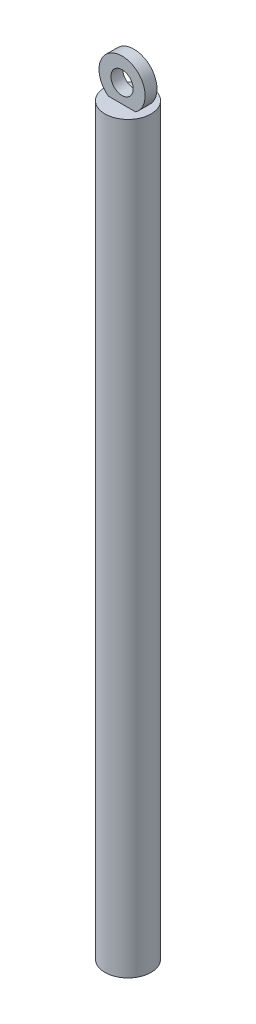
ISO-10303-21;
HEADER;
FILE_DESCRIPTION(('STEP AP214'),'2;1');
FILE_NAME('part.step','',(''),(''),'','','');
FILE_SCHEMA(('AUTOMOTIVE_DESIGN { 1 0 10303 214 1 1 1 1 }'));
ENDSEC;
DATA;
#1=APPLICATION_CONTEXT('core data for automotive mechanical design processes');
#2=APPLICATION_PROTOCOL_DEFINITION('international standard','automotive_design',2000,#1);
#3=PRODUCT_CONTEXT('',#1,'mechanical');
#4=PRODUCT('Part','Part','',(#3));
#5=PRODUCT_RELATED_PRODUCT_CATEGORY('part','',(#4));
#6=PRODUCT_DEFINITION_FORMATION('','',#4);
#7=PRODUCT_DEFINITION_CONTEXT('part definition',#1,'design');
#8=PRODUCT_DEFINITION('design','',#6,#7);
#9=PRODUCT_DEFINITION_SHAPE('','',#8);
#10=(LENGTH_UNIT() NAMED_UNIT(*) SI_UNIT(.MILLI.,.METRE.));
#11=(NAMED_UNIT(*) PLANE_ANGLE_UNIT() SI_UNIT($,.RADIAN.));
#12=(NAMED_UNIT(*) SI_UNIT($,.STERADIAN.) SOLID_ANGLE_UNIT());
#13=UNCERTAINTY_MEASURE_WITH_UNIT(LENGTH_MEASURE(1.E-05),#10,'distance_accuracy_value','');
#14=(GEOMETRIC_REPRESENTATION_CONTEXT(3) GLOBAL_UNCERTAINTY_ASSIGNED_CONTEXT((#13)) GLOBAL_UNIT_ASSIGNED_CONTEXT((#10,
#11,#12)) REPRESENTATION_CONTEXT('',''));
#15=CARTESIAN_POINT('',(0.,0.,0.));
#16=DIRECTION('',(0.,0.,1.));
#17=DIRECTION('',(1.,0.,0.));
#18=AXIS2_PLACEMENT_3D('',#15,#16,#17);
#19=CARTESIAN_POINT('',(0.,0.25,-0.4));
#20=DIRECTION('',(0.,0.,1.));
#21=DIRECTION('',(1.,0.,0.));
#22=AXIS2_PLACEMENT_3D('',#19,#20,#21);
#23=CYLINDRICAL_SURFACE('',#22,1.55);
#24=DIRECTION('',(0.,0.,1.));
#25=VECTOR('',#24,1.);
#26=CARTESIAN_POINT('',(0.916515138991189,-0.999999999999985,-0.4));
#27=LINE('',#26,#25);
#28=CARTESIAN_POINT('',(0.916515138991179,-0.999999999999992,0.4));
#29=VERTEX_POINT('',#28);
#30=CARTESIAN_POINT('',(0.916515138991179,-0.999999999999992,-0.4));
#31=VERTEX_POINT('',#30);
#32=EDGE_CURVE('E34',#29,#31,#27,.F.);
#33=ORIENTED_EDGE('',*,*,#32,.T.);
#34=CARTESIAN_POINT('',(0.,0.25,-0.4));
#35=DIRECTION('',(0.,0.,1.));
#36=DIRECTION('',(1.,0.,0.));
#37=AXIS2_PLACEMENT_3D('',#34,#35,#36);
#38=CIRCLE('',#37,1.55);
#39=CARTESIAN_POINT('',(-0.916515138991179,-0.999999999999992,-0.4));
#40=VERTEX_POINT('',#39);
#41=EDGE_CURVE('E19',#31,#40,#38,.T.);
#42=ORIENTED_EDGE('',*,*,#41,.T.);
#43=DIRECTION('',(0.,0.,1.));
#44=VECTOR('',#43,1.);
#45=CARTESIAN_POINT('',(-0.916515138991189,-0.999999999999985,-0.4));
#46=LINE('',#45,#44);
#47=CARTESIAN_POINT('',(-0.916515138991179,-0.999999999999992,0.4));
#48=VERTEX_POINT('',#47);
#49=EDGE_CURVE('E43',#40,#48,#46,.T.);
#50=ORIENTED_EDGE('',*,*,#49,.T.);
#51=CARTESIAN_POINT('',(0.,0.25,0.4));
#52=DIRECTION('',(0.,0.,1.));
#53=DIRECTION('',(1.,0.,0.));
#54=AXIS2_PLACEMENT_3D('',#51,#52,#53);
#55=CIRCLE('',#54,1.55);
#56=EDGE_CURVE('E59',#29,#48,#55,.T.);
#57=ORIENTED_EDGE('',*,*,#56,.F.);
#58=EDGE_LOOP('',(#33,#42,#50,#57));
#59=FACE_BOUND('',#58,.T.);
#60=ADVANCED_FACE('F16',(#59),#23,.T.);
#61=CARTESIAN_POINT('',(0.,0.25,-0.4));
#62=DIRECTION('',(0.,0.,1.));
#63=DIRECTION('',(1.,0.,0.));
#64=AXIS2_PLACEMENT_3D('',#61,#62,#63);
#65=CYLINDRICAL_SURFACE('',#64,0.75);
#66=CARTESIAN_POINT('',(0.,0.25,0.4));
#67=DIRECTION('',(0.,0.,1.));
#68=DIRECTION('',(1.,0.,0.));
#69=AXIS2_PLACEMENT_3D('',#66,#67,#68);
#70=CIRCLE('',#69,0.75);
#71=CARTESIAN_POINT('',(0.75,0.25,0.4));
#72=VERTEX_POINT('',#71);
#73=EDGE_CURVE('E55',#72,#72,#70,.F.);
#74=ORIENTED_EDGE('',*,*,#73,.F.);
#75=EDGE_LOOP('',(#74));
#76=FACE_BOUND('',#75,.T.);
#77=CARTESIAN_POINT('',(0.,0.25,-0.4));
#78=DIRECTION('',(0.,0.,1.));
#79=DIRECTION('',(1.,0.,0.));
#80=AXIS2_PLACEMENT_3D('',#77,#78,#79);
#81=CIRCLE('',#80,0.75);
#82=CARTESIAN_POINT('',(0.75,0.25,-0.4));
#83=VERTEX_POINT('',#82);
#84=EDGE_CURVE('E53',#83,#83,#81,.F.);
#85=ORIENTED_EDGE('',*,*,#84,.T.);
#86=EDGE_LOOP('',(#85));
#87=FACE_BOUND('',#86,.T.);
#88=ADVANCED_FACE('F68',(#76,#87),#65,.F.);
#89=CARTESIAN_POINT('',(0.,0.,-0.4));
#90=DIRECTION('',(0.,0.,1.));
#91=DIRECTION('',(1.,0.,0.));
#92=AXIS2_PLACEMENT_3D('',#89,#90,#91);
#93=PLANE('',#92);
#94=ORIENTED_EDGE('',*,*,#84,.F.);
#95=EDGE_LOOP('',(#94));
#96=FACE_BOUND('',#95,.T.);
#97=DIRECTION('',(1.,0.,0.));
#98=VECTOR('',#97,1.);
#99=CARTESIAN_POINT('',(0.,-1.,-0.4));
#100=LINE('',#99,#98);
#101=EDGE_CURVE('E47',#31,#40,#100,.F.);
#102=ORIENTED_EDGE('',*,*,#101,.T.);
#103=ORIENTED_EDGE('',*,*,#41,.F.);
#104=EDGE_LOOP('',(#102,#103));
#105=FACE_BOUND('',#104,.T.);
#106=ADVANCED_FACE('F54',(#96,#105),#93,.F.);
#107=CARTESIAN_POINT('',(0.,0.,0.4));
#108=DIRECTION('',(0.,0.,1.));
#109=DIRECTION('',(1.,0.,0.));
#110=AXIS2_PLACEMENT_3D('',#107,#108,#109);
#111=PLANE('',#110);
#112=ORIENTED_EDGE('',*,*,#73,.T.);
#113=EDGE_LOOP('',(#112));
#114=FACE_BOUND('',#113,.T.);
#115=ORIENTED_EDGE('',*,*,#56,.T.);
#116=DIRECTION('',(1.,0.,0.));
#117=VECTOR('',#116,1.);
#118=CARTESIAN_POINT('',(0.,-1.,0.4));
#119=LINE('',#118,#117);
#120=EDGE_CURVE('E49',#48,#29,#119,.T.);
#121=ORIENTED_EDGE('',*,*,#120,.T.);
#122=EDGE_LOOP('',(#115,#121));
#123=FACE_BOUND('',#122,.T.);
#124=ADVANCED_FACE('F71',(#114,#123),#111,.T.);
#125=CARTESIAN_POINT('',(0.,-51.,0.));
#126=DIRECTION('',(0.,-1.,0.));
#127=DIRECTION('',(0.,0.,-1.));
#128=AXIS2_PLACEMENT_3D('',#125,#126,#127);
#129=PLANE('',#128);
#130=CARTESIAN_POINT('',(0.,-51.,0.));
#131=DIRECTION('',(0.,-1.,0.));
#132=DIRECTION('',(0.,0.,-1.));
#133=AXIS2_PLACEMENT_3D('',#130,#131,#132);
#134=CIRCLE('',#133,1.55);
#135=CARTESIAN_POINT('',(0.,-51.,-1.55));
#136=VERTEX_POINT('',#135);
#137=EDGE_CURVE('E25',#136,#136,#134,.F.);
#138=ORIENTED_EDGE('',*,*,#137,.F.);
#139=EDGE_LOOP('',(#138));
#140=FACE_BOUND('',#139,.T.);
#141=ADVANCED_FACE('F78',(#140),#129,.T.);
#142=CARTESIAN_POINT('',(0.,-1.,0.));
#143=DIRECTION('',(0.,-1.,0.));
#144=DIRECTION('',(0.,0.,-1.));
#145=AXIS2_PLACEMENT_3D('',#142,#143,#144);
#146=PLANE('',#145);
#147=ORIENTED_EDGE('',*,*,#120,.F.);
#148=ORIENTED_EDGE('',*,*,#49,.F.);
#149=ORIENTED_EDGE('',*,*,#101,.F.);
#150=ORIENTED_EDGE('',*,*,#32,.F.);
#151=EDGE_LOOP('',(#147,#148,#149,#150));
#152=FACE_BOUND('',#151,.T.);
#153=CARTESIAN_POINT('',(0.,-1.,0.));
#154=DIRECTION('',(0.,-1.,0.));
#155=DIRECTION('',(0.,0.,-1.));
#156=AXIS2_PLACEMENT_3D('',#153,#154,#155);
#157=CIRCLE('',#156,1.55);
#158=CARTESIAN_POINT('',(0.,-1.,-1.55));
#159=VERTEX_POINT('',#158);
#160=EDGE_CURVE('E11',#159,#159,#157,.T.);
#161=ORIENTED_EDGE('',*,*,#160,.F.);
#162=EDGE_LOOP('',(#161));
#163=FACE_BOUND('',#162,.T.);
#164=ADVANCED_FACE('F44',(#152,#163),#146,.F.);
#165=CARTESIAN_POINT('',(0.,-1.,0.));
#166=DIRECTION('',(0.,-1.,0.));
#167=DIRECTION('',(0.,0.,-1.));
#168=AXIS2_PLACEMENT_3D('',#165,#166,#167);
#169=CYLINDRICAL_SURFACE('',#168,1.55);
#170=ORIENTED_EDGE('',*,*,#137,.T.);
#171=EDGE_LOOP('',(#170));
#172=FACE_BOUND('',#171,.T.);
#173=ORIENTED_EDGE('',*,*,#160,.T.);
#174=EDGE_LOOP('',(#173));
#175=FACE_BOUND('',#174,.T.);
#176=ADVANCED_FACE('F82',(#172,#175),#169,.T.);
#177=CLOSED_SHELL('',(#60,#88,#106,#124,#141,#164,#176));
#178=MANIFOLD_SOLID_BREP('B1',#177);
#179=ADVANCED_BREP_SHAPE_REPRESENTATION('',(#18,#178),#14);
#180=SHAPE_DEFINITION_REPRESENTATION(#9,#179);
ENDSEC;
END-ISO-10303-21;
